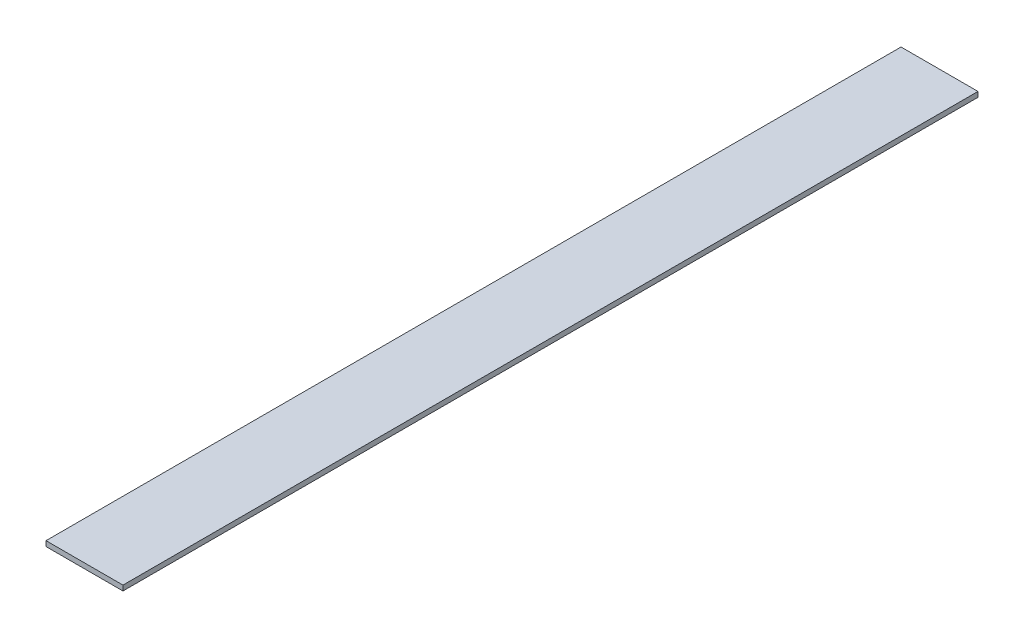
ISO-10303-21;
HEADER;
FILE_DESCRIPTION(('STEP AP214'),'2;1');
FILE_NAME('part.step','',(''),(''),'','','');
FILE_SCHEMA(('AUTOMOTIVE_DESIGN { 1 0 10303 214 1 1 1 1 }'));
ENDSEC;
DATA;
#1=APPLICATION_CONTEXT('core data for automotive mechanical design processes');
#2=APPLICATION_PROTOCOL_DEFINITION('international standard','automotive_design',2000,#1);
#3=PRODUCT_CONTEXT('',#1,'mechanical');
#4=PRODUCT('Part','Part','',(#3));
#5=PRODUCT_RELATED_PRODUCT_CATEGORY('part','',(#4));
#6=PRODUCT_DEFINITION_FORMATION('','',#4);
#7=PRODUCT_DEFINITION_CONTEXT('part definition',#1,'design');
#8=PRODUCT_DEFINITION('design','',#6,#7);
#9=PRODUCT_DEFINITION_SHAPE('','',#8);
#10=(LENGTH_UNIT() NAMED_UNIT(*) SI_UNIT(.MILLI.,.METRE.));
#11=(NAMED_UNIT(*) PLANE_ANGLE_UNIT() SI_UNIT($,.RADIAN.));
#12=(NAMED_UNIT(*) SI_UNIT($,.STERADIAN.) SOLID_ANGLE_UNIT());
#13=UNCERTAINTY_MEASURE_WITH_UNIT(LENGTH_MEASURE(1.E-05),#10,'distance_accuracy_value','');
#14=(GEOMETRIC_REPRESENTATION_CONTEXT(3) GLOBAL_UNCERTAINTY_ASSIGNED_CONTEXT((#13)) GLOBAL_UNIT_ASSIGNED_CONTEXT((#10,
#11,#12)) REPRESENTATION_CONTEXT('',''));
#15=CARTESIAN_POINT('',(0.,0.,0.));
#16=DIRECTION('',(0.,0.,1.));
#17=DIRECTION('',(1.,0.,0.));
#18=AXIS2_PLACEMENT_3D('',#15,#16,#17);
#19=CARTESIAN_POINT('',(22.5,0.,0.));
#20=DIRECTION('',(-1.,0.,0.));
#21=DIRECTION('',(0.,0.,1.));
#22=AXIS2_PLACEMENT_3D('',#19,#20,#21);
#23=PLANE('',#22);
#24=DIRECTION('',(0.,-1.,0.));
#25=VECTOR('',#24,1.);
#26=CARTESIAN_POINT('',(22.5,1.5,0.));
#27=LINE('',#26,#25);
#28=CARTESIAN_POINT('',(22.5,3.,0.));
#29=VERTEX_POINT('',#28);
#30=CARTESIAN_POINT('',(22.5,0.,0.));
#31=VERTEX_POINT('',#30);
#32=EDGE_CURVE('E51',#29,#31,#27,.T.);
#33=ORIENTED_EDGE('',*,*,#32,.F.);
#34=DIRECTION('',(0.,0.,-1.));
#35=VECTOR('',#34,1.);
#36=CARTESIAN_POINT('',(22.5,3.,250.));
#37=LINE('',#36,#35);
#38=CARTESIAN_POINT('',(22.5,3.,500.));
#39=VERTEX_POINT('',#38);
#40=EDGE_CURVE('E66',#39,#29,#37,.T.);
#41=ORIENTED_EDGE('',*,*,#40,.F.);
#42=DIRECTION('',(0.,-1.,0.));
#43=VECTOR('',#42,1.);
#44=CARTESIAN_POINT('',(22.5,1.5,500.));
#45=LINE('',#44,#43);
#46=CARTESIAN_POINT('',(22.5,0.,500.));
#47=VERTEX_POINT('',#46);
#48=EDGE_CURVE('E18',#39,#47,#45,.T.);
#49=ORIENTED_EDGE('',*,*,#48,.T.);
#50=DIRECTION('',(0.,0.,1.));
#51=VECTOR('',#50,1.);
#52=CARTESIAN_POINT('',(22.5,0.,250.));
#53=LINE('',#52,#51);
#54=EDGE_CURVE('E56',#31,#47,#53,.T.);
#55=ORIENTED_EDGE('',*,*,#54,.F.);
#56=EDGE_LOOP('',(#33,#41,#49,#55));
#57=FACE_BOUND('',#56,.T.);
#58=ADVANCED_FACE('F14',(#57),#23,.F.);
#59=CARTESIAN_POINT('',(22.5,0.,500.));
#60=DIRECTION('',(0.,0.,-1.));
#61=DIRECTION('',(-1.,0.,0.));
#62=AXIS2_PLACEMENT_3D('',#59,#60,#61);
#63=PLANE('',#62);
#64=DIRECTION('',(-1.,0.,0.));
#65=VECTOR('',#64,1.);
#66=CARTESIAN_POINT('',(0.,0.,500.));
#67=LINE('',#66,#65);
#68=CARTESIAN_POINT('',(-22.5,0.,500.));
#69=VERTEX_POINT('',#68);
#70=EDGE_CURVE('E61',#47,#69,#67,.T.);
#71=ORIENTED_EDGE('',*,*,#70,.F.);
#72=ORIENTED_EDGE('',*,*,#48,.F.);
#73=DIRECTION('',(1.,0.,0.));
#74=VECTOR('',#73,1.);
#75=CARTESIAN_POINT('',(0.,3.,500.));
#76=LINE('',#75,#74);
#77=CARTESIAN_POINT('',(-22.5,3.,500.));
#78=VERTEX_POINT('',#77);
#79=EDGE_CURVE('E79',#78,#39,#76,.T.);
#80=ORIENTED_EDGE('',*,*,#79,.F.);
#81=DIRECTION('',(0.,-1.,0.));
#82=VECTOR('',#81,1.);
#83=CARTESIAN_POINT('',(-22.5,1.5,500.));
#84=LINE('',#83,#82);
#85=EDGE_CURVE('E72',#78,#69,#84,.T.);
#86=ORIENTED_EDGE('',*,*,#85,.T.);
#87=EDGE_LOOP('',(#71,#72,#80,#86));
#88=FACE_BOUND('',#87,.T.);
#89=ADVANCED_FACE('F71',(#88),#63,.F.);
#90=CARTESIAN_POINT('',(-22.5,0.,500.));
#91=DIRECTION('',(0.,-1.,0.));
#92=DIRECTION('',(0.,0.,-1.));
#93=AXIS2_PLACEMENT_3D('',#90,#91,#92);
#94=PLANE('',#93);
#95=ORIENTED_EDGE('',*,*,#70,.T.);
#96=DIRECTION('',(0.,0.,-1.));
#97=VECTOR('',#96,1.);
#98=CARTESIAN_POINT('',(-22.5,0.,250.));
#99=LINE('',#98,#97);
#100=CARTESIAN_POINT('',(-22.5,0.,0.));
#101=VERTEX_POINT('',#100);
#102=EDGE_CURVE('E82',#69,#101,#99,.T.);
#103=ORIENTED_EDGE('',*,*,#102,.T.);
#104=DIRECTION('',(-1.,0.,0.));
#105=VECTOR('',#104,1.);
#106=CARTESIAN_POINT('',(0.,0.,0.));
#107=LINE('',#106,#105);
#108=EDGE_CURVE('E63',#31,#101,#107,.T.);
#109=ORIENTED_EDGE('',*,*,#108,.F.);
#110=ORIENTED_EDGE('',*,*,#54,.T.);
#111=EDGE_LOOP('',(#95,#103,#109,#110));
#112=FACE_BOUND('',#111,.T.);
#113=ADVANCED_FACE('F58',(#112),#94,.T.);
#114=CARTESIAN_POINT('',(22.5,0.,0.));
#115=DIRECTION('',(0.,0.,-1.));
#116=DIRECTION('',(-1.,0.,0.));
#117=AXIS2_PLACEMENT_3D('',#114,#115,#116);
#118=PLANE('',#117);
#119=ORIENTED_EDGE('',*,*,#32,.T.);
#120=ORIENTED_EDGE('',*,*,#108,.T.);
#121=DIRECTION('',(0.,1.,0.));
#122=VECTOR('',#121,1.);
#123=CARTESIAN_POINT('',(-22.5,1.5,0.));
#124=LINE('',#123,#122);
#125=CARTESIAN_POINT('',(-22.5,3.,0.));
#126=VERTEX_POINT('',#125);
#127=EDGE_CURVE('E24',#101,#126,#124,.T.);
#128=ORIENTED_EDGE('',*,*,#127,.T.);
#129=DIRECTION('',(-1.,0.,0.));
#130=VECTOR('',#129,1.);
#131=CARTESIAN_POINT('',(0.,3.,0.));
#132=LINE('',#131,#130);
#133=EDGE_CURVE('E32',#29,#126,#132,.T.);
#134=ORIENTED_EDGE('',*,*,#133,.F.);
#135=EDGE_LOOP('',(#119,#120,#128,#134));
#136=FACE_BOUND('',#135,.T.);
#137=ADVANCED_FACE('F86',(#136),#118,.T.);
#138=CARTESIAN_POINT('',(22.5,3.,0.));
#139=DIRECTION('',(0.,1.,0.));
#140=DIRECTION('',(-1.,0.,0.));
#141=AXIS2_PLACEMENT_3D('',#138,#139,#140);
#142=PLANE('',#141);
#143=DIRECTION('',(0.,0.,1.));
#144=VECTOR('',#143,1.);
#145=CARTESIAN_POINT('',(-22.5,3.,250.));
#146=LINE('',#145,#144);
#147=EDGE_CURVE('E9',#126,#78,#146,.T.);
#148=ORIENTED_EDGE('',*,*,#147,.T.);
#149=ORIENTED_EDGE('',*,*,#79,.T.);
#150=ORIENTED_EDGE('',*,*,#40,.T.);
#151=ORIENTED_EDGE('',*,*,#133,.T.);
#152=EDGE_LOOP('',(#148,#149,#150,#151));
#153=FACE_BOUND('',#152,.T.);
#154=ADVANCED_FACE('F88',(#153),#142,.T.);
#155=CARTESIAN_POINT('',(-22.5,0.,500.));
#156=DIRECTION('',(1.,0.,0.));
#157=DIRECTION('',(0.,0.,-1.));
#158=AXIS2_PLACEMENT_3D('',#155,#156,#157);
#159=PLANE('',#158);
#160=ORIENTED_EDGE('',*,*,#127,.F.);
#161=ORIENTED_EDGE('',*,*,#102,.F.);
#162=ORIENTED_EDGE('',*,*,#85,.F.);
#163=ORIENTED_EDGE('',*,*,#147,.F.);
#164=EDGE_LOOP('',(#160,#161,#162,#163));
#165=FACE_BOUND('',#164,.T.);
#166=ADVANCED_FACE('F16',(#165),#159,.F.);
#167=CLOSED_SHELL('',(#58,#89,#113,#137,#154,#166));
#168=MANIFOLD_SOLID_BREP('B1',#167);
#169=ADVANCED_BREP_SHAPE_REPRESENTATION('',(#18,#168),#14);
#170=SHAPE_DEFINITION_REPRESENTATION(#9,#169);
ENDSEC;
END-ISO-10303-21;
